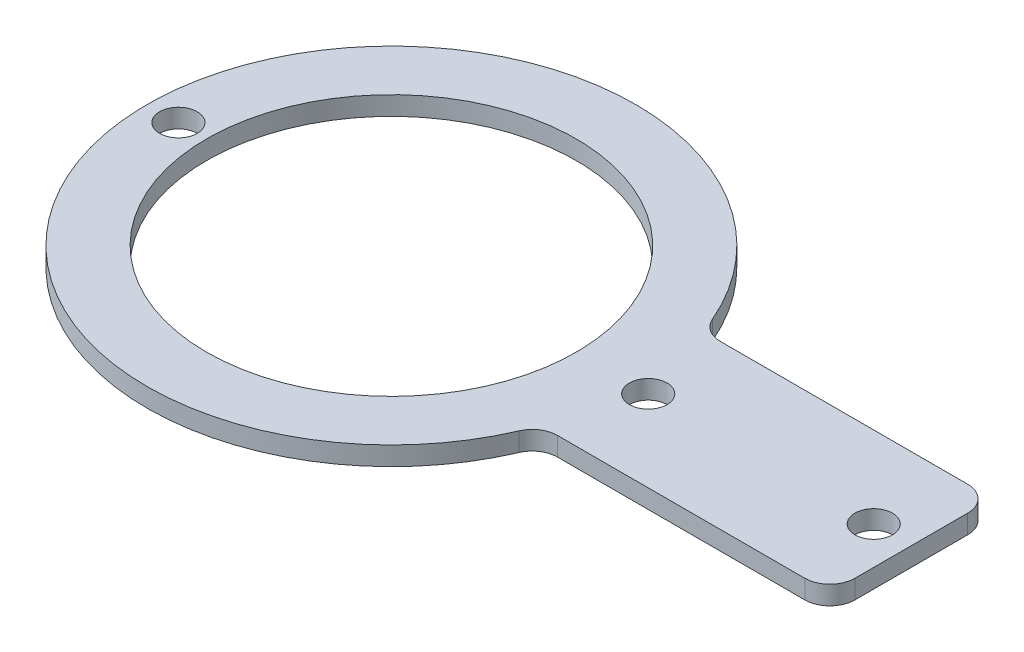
from build123d import *

# Parameters (mm, degrees)
EXTRUDE_1_DEPTH     = 1.5
SKETCH_2_R          = 14.75
CUT_EXTRUDE_1_DEPTH = 46.877554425
SKETCH_4_R          = 1.5
CUT_EXTRUDE_3_DEPTH = 46.877554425


with BuildPart() as part:
    # Sketch 1 → Extrude 1 (new body)
    with BuildSketch(Plane(origin=(0, 0, 0), x_dir=(1, 0, 0), z_dir=(0, 1, 0))):
        with BuildLine():
            Line((19.748417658, -6.5), (39.5, -6.5))
            ThreePointArc((39.5, -6.5), (40.914213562, -5.914213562), (41.5, -4.5))
            Line((41.5, -4.5), (41.5, 4.5))
            ThreePointArc((41.5, 4.5), (40.914213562, 5.914213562), (39.5, 6.5))
            Line((39.5, 6.5), (19.748417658, 6.5))
            ThreePointArc((19.748417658, 6.5), (18.648734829, 6.829461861), (17.91135555, 7.709302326))
            ThreePointArc((17.91135555, 7.709302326), (-19.5, 0), (17.91135555, -7.709302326))
            ThreePointArc((17.91135555, -7.709302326), (18.648734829, -6.829461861), (19.748417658, -6.5))
        make_face()
    extrude(amount=EXTRUDE_1_DEPTH)

    # Sketch 2 → Cut-Extrude 1 (cut, through all)
    with BuildSketch(Plane(origin=(0, 1.5, 0), x_dir=(1, 0, 0), z_dir=(0, 1, 0))):
        with Locations(Location((0, 0, 0), (0, 0, 270))):
            Circle(SKETCH_2_R)
    extrude(amount=-CUT_EXTRUDE_1_DEPTH, mode=Mode.SUBTRACT)

    # Sketch 4 → Cut-Extrude 3 (cut, through all)
    with BuildSketch(Plane(origin=(0, 1.5, 0), x_dir=(1, 0, 0), z_dir=(0, 1, 0))):
        with Locations(Location((-17, 0, 0), (0, 0, 270))):
            Circle(SKETCH_4_R)
        with Locations(Location((20.5, 0, 0), (0, 0, 270))):
            Circle(SKETCH_4_R)
        with Locations(Location((38.5, 0, 0), (0, 0, 270))):
            Circle(SKETCH_4_R)
    extrude(amount=-CUT_EXTRUDE_3_DEPTH, mode=Mode.SUBTRACT)


solid = part.part
